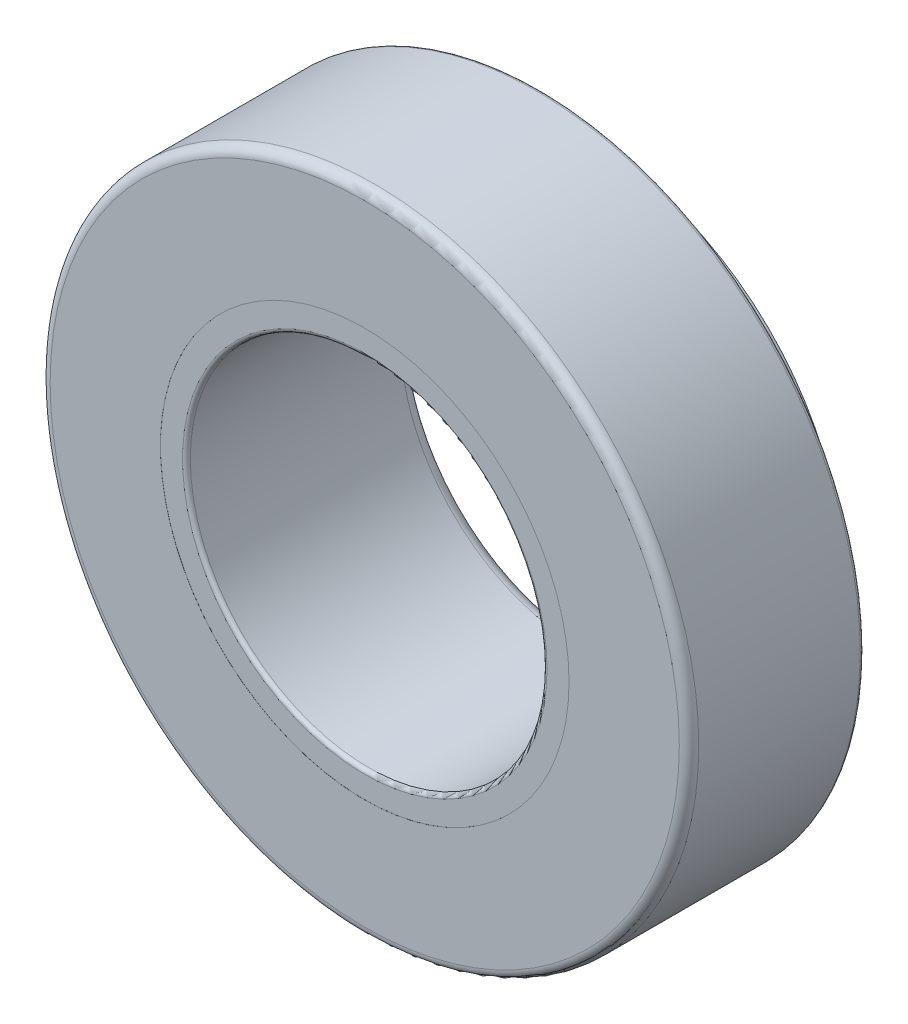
ISO-10303-21;
HEADER;
FILE_DESCRIPTION(('STEP AP214'),'2;1');
FILE_NAME('part.step','',(''),(''),'','','');
FILE_SCHEMA(('AUTOMOTIVE_DESIGN { 1 0 10303 214 1 1 1 1 }'));
ENDSEC;
DATA;
#1=APPLICATION_CONTEXT('core data for automotive mechanical design processes');
#2=APPLICATION_PROTOCOL_DEFINITION('international standard','automotive_design',2000,#1);
#3=PRODUCT_CONTEXT('',#1,'mechanical');
#4=PRODUCT('Part','Part','',(#3));
#5=PRODUCT_RELATED_PRODUCT_CATEGORY('part','',(#4));
#6=PRODUCT_DEFINITION_FORMATION('','',#4);
#7=PRODUCT_DEFINITION_CONTEXT('part definition',#1,'design');
#8=PRODUCT_DEFINITION('design','',#6,#7);
#9=PRODUCT_DEFINITION_SHAPE('','',#8);
#10=(LENGTH_UNIT() NAMED_UNIT(*) SI_UNIT(.MILLI.,.METRE.));
#11=(NAMED_UNIT(*) PLANE_ANGLE_UNIT() SI_UNIT($,.RADIAN.));
#12=(NAMED_UNIT(*) SI_UNIT($,.STERADIAN.) SOLID_ANGLE_UNIT());
#13=UNCERTAINTY_MEASURE_WITH_UNIT(LENGTH_MEASURE(1.E-05),#10,'distance_accuracy_value','');
#14=(GEOMETRIC_REPRESENTATION_CONTEXT(3) GLOBAL_UNCERTAINTY_ASSIGNED_CONTEXT((#13)) GLOBAL_UNIT_ASSIGNED_CONTEXT((#10,
#11,#12)) REPRESENTATION_CONTEXT('',''));
#15=CARTESIAN_POINT('',(0.,0.,0.));
#16=DIRECTION('',(0.,0.,1.));
#17=DIRECTION('',(1.,0.,0.));
#18=AXIS2_PLACEMENT_3D('',#15,#16,#17);
#19=CARTESIAN_POINT('',(0.,0.,59.9913216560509));
#20=DIRECTION('',(0.,0.,1.));
#21=DIRECTION('',(1.,0.,0.));
#22=AXIS2_PLACEMENT_3D('',#19,#20,#21);
#23=CYLINDRICAL_SURFACE('',#22,38.8);
#24=CARTESIAN_POINT('',(0.,0.,-31.));
#25=DIRECTION('',(0.,0.,1.));
#26=DIRECTION('',(1.,0.,0.));
#27=AXIS2_PLACEMENT_3D('',#24,#25,#26);
#28=CIRCLE('',#27,38.8);
#29=CARTESIAN_POINT('',(38.8,0.,-31.));
#30=VERTEX_POINT('',#29);
#31=EDGE_CURVE('E10',#30,#30,#28,.T.);
#32=ORIENTED_EDGE('',*,*,#31,.F.);
#33=EDGE_LOOP('',(#32));
#34=FACE_BOUND('',#33,.T.);
#35=CARTESIAN_POINT('',(0.,0.,-35.));
#36=DIRECTION('',(0.,0.,1.));
#37=DIRECTION('',(1.,0.,0.));
#38=AXIS2_PLACEMENT_3D('',#35,#36,#37);
#39=CIRCLE('',#38,38.8);
#40=CARTESIAN_POINT('',(38.8,0.,-35.));
#41=VERTEX_POINT('',#40);
#42=EDGE_CURVE('E76',#41,#41,#39,.T.);
#43=ORIENTED_EDGE('',*,*,#42,.T.);
#44=EDGE_LOOP('',(#43));
#45=FACE_BOUND('',#44,.T.);
#46=ADVANCED_FACE('F30',(#34,#45),#23,.T.);
#47=CARTESIAN_POINT('',(0.,38.8,-31.));
#48=DIRECTION('',(0.,0.,1.));
#49=DIRECTION('',(1.,0.,0.));
#50=AXIS2_PLACEMENT_3D('',#47,#48,#49);
#51=PLANE('',#50);
#52=CARTESIAN_POINT('',(0.,0.,-31.));
#53=DIRECTION('',(0.,0.,1.));
#54=DIRECTION('',(1.,0.,0.));
#55=AXIS2_PLACEMENT_3D('',#52,#53,#54);
#56=CIRCLE('',#55,42.5);
#57=CARTESIAN_POINT('',(42.5,0.,-31.));
#58=VERTEX_POINT('',#57);
#59=EDGE_CURVE('E36',#58,#58,#56,.T.);
#60=ORIENTED_EDGE('',*,*,#59,.F.);
#61=EDGE_LOOP('',(#60));
#62=FACE_BOUND('',#61,.T.);
#63=ORIENTED_EDGE('',*,*,#31,.T.);
#64=EDGE_LOOP('',(#63));
#65=FACE_BOUND('',#64,.T.);
#66=ADVANCED_FACE('F193',(#62,#65),#51,.F.);
#67=CARTESIAN_POINT('',(0.,0.,-31.));
#68=DIRECTION('',(0.,0.,-1.));
#69=DIRECTION('',(-1.,0.,0.));
#70=AXIS2_PLACEMENT_3D('',#67,#68,#69);
#71=CONICAL_SURFACE('',#70,42.5,0.191184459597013);
#72=CARTESIAN_POINT('',(0.,0.,-27.));
#73=DIRECTION('',(0.,0.,1.));
#74=DIRECTION('',(1.,0.,0.));
#75=AXIS2_PLACEMENT_3D('',#72,#73,#74);
#76=CIRCLE('',#75,41.7258064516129);
#77=CARTESIAN_POINT('',(41.7258064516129,0.,-27.));
#78=VERTEX_POINT('',#77);
#79=EDGE_CURVE('E40',#78,#78,#76,.T.);
#80=ORIENTED_EDGE('',*,*,#79,.F.);
#81=EDGE_LOOP('',(#80));
#82=FACE_BOUND('',#81,.T.);
#83=ORIENTED_EDGE('',*,*,#59,.T.);
#84=EDGE_LOOP('',(#83));
#85=FACE_BOUND('',#84,.T.);
#86=ADVANCED_FACE('F190',(#82,#85),#71,.T.);
#87=CARTESIAN_POINT('',(0.,41.7258064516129,-27.));
#88=DIRECTION('',(0.,0.,1.));
#89=DIRECTION('',(1.,0.,0.));
#90=AXIS2_PLACEMENT_3D('',#87,#88,#89);
#91=PLANE('',#90);
#92=CARTESIAN_POINT('',(0.,0.,-27.));
#93=DIRECTION('',(0.,0.,1.));
#94=DIRECTION('',(1.,0.,0.));
#95=AXIS2_PLACEMENT_3D('',#92,#93,#94);
#96=CIRCLE('',#95,49.4);
#97=CARTESIAN_POINT('',(49.4,0.,-27.));
#98=VERTEX_POINT('',#97);
#99=EDGE_CURVE('E44',#98,#98,#96,.T.);
#100=ORIENTED_EDGE('',*,*,#99,.F.);
#101=EDGE_LOOP('',(#100));
#102=FACE_BOUND('',#101,.T.);
#103=ORIENTED_EDGE('',*,*,#79,.T.);
#104=EDGE_LOOP('',(#103));
#105=FACE_BOUND('',#104,.T.);
#106=ADVANCED_FACE('F186',(#102,#105),#91,.F.);
#107=CARTESIAN_POINT('',(0.,0.,-26.4));
#108=DIRECTION('',(0.,0.,1.));
#109=DIRECTION('',(1.,0.,0.));
#110=AXIS2_PLACEMENT_3D('',#107,#108,#109);
#111=TOROIDAL_SURFACE('',#110,49.4,0.600000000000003);
#112=CARTESIAN_POINT('',(0.,0.,-26.4));
#113=DIRECTION('',(0.,0.,1.));
#114=DIRECTION('',(1.,0.,0.));
#115=AXIS2_PLACEMENT_3D('',#112,#113,#114);
#116=CIRCLE('',#115,50.);
#117=CARTESIAN_POINT('',(50.,0.,-26.4));
#118=VERTEX_POINT('',#117);
#119=EDGE_CURVE('E49',#118,#118,#116,.T.);
#120=ORIENTED_EDGE('',*,*,#119,.F.);
#121=EDGE_LOOP('',(#120));
#122=FACE_BOUND('',#121,.T.);
#123=ORIENTED_EDGE('',*,*,#99,.T.);
#124=EDGE_LOOP('',(#123));
#125=FACE_BOUND('',#124,.T.);
#126=ADVANCED_FACE('F182',(#122,#125),#111,.T.);
#127=CARTESIAN_POINT('',(0.,0.,59.9913216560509));
#128=DIRECTION('',(0.,0.,1.));
#129=DIRECTION('',(1.,0.,0.));
#130=AXIS2_PLACEMENT_3D('',#127,#128,#129);
#131=CYLINDRICAL_SURFACE('',#130,50.);
#132=ORIENTED_EDGE('',*,*,#119,.T.);
#133=EDGE_LOOP('',(#132));
#134=FACE_BOUND('',#133,.T.);
#135=CARTESIAN_POINT('',(0.,0.,-1.5));
#136=DIRECTION('',(0.,0.,1.));
#137=DIRECTION('',(1.,0.,0.));
#138=AXIS2_PLACEMENT_3D('',#135,#136,#137);
#139=CIRCLE('',#138,50.);
#140=CARTESIAN_POINT('',(50.,0.,-1.5));
#141=VERTEX_POINT('',#140);
#142=EDGE_CURVE('E52',#141,#141,#139,.T.);
#143=ORIENTED_EDGE('',*,*,#142,.F.);
#144=EDGE_LOOP('',(#143));
#145=FACE_BOUND('',#144,.T.);
#146=ADVANCED_FACE('F178',(#134,#145),#131,.T.);
#147=CARTESIAN_POINT('',(0.,0.,-1.5));
#148=DIRECTION('',(0.,0.,1.));
#149=DIRECTION('',(1.,0.,0.));
#150=AXIS2_PLACEMENT_3D('',#147,#148,#149);
#151=TOROIDAL_SURFACE('',#150,48.5,1.5);
#152=CARTESIAN_POINT('',(0.,0.,0.));
#153=DIRECTION('',(0.,0.,1.));
#154=DIRECTION('',(1.,0.,0.));
#155=AXIS2_PLACEMENT_3D('',#152,#153,#154);
#156=CIRCLE('',#155,48.5);
#157=CARTESIAN_POINT('',(48.5,0.,0.));
#158=VERTEX_POINT('',#157);
#159=EDGE_CURVE('E55',#158,#158,#156,.T.);
#160=ORIENTED_EDGE('',*,*,#159,.F.);
#161=EDGE_LOOP('',(#160));
#162=FACE_BOUND('',#161,.T.);
#163=ORIENTED_EDGE('',*,*,#142,.T.);
#164=EDGE_LOOP('',(#163));
#165=FACE_BOUND('',#164,.T.);
#166=ADVANCED_FACE('F174',(#162,#165),#151,.T.);
#167=CARTESIAN_POINT('',(0.,31.5,0.));
#168=DIRECTION('',(0.,0.,1.));
#169=DIRECTION('',(1.,0.,0.));
#170=AXIS2_PLACEMENT_3D('',#167,#168,#169);
#171=PLANE('',#170);
#172=ORIENTED_EDGE('',*,*,#159,.T.);
#173=EDGE_LOOP('',(#172));
#174=FACE_BOUND('',#173,.T.);
#175=CARTESIAN_POINT('',(0.,0.,0.));
#176=DIRECTION('',(0.,0.,1.));
#177=DIRECTION('',(1.,0.,0.));
#178=AXIS2_PLACEMENT_3D('',#175,#176,#177);
#179=CIRCLE('',#178,31.5);
#180=CARTESIAN_POINT('',(31.5,0.,0.));
#181=VERTEX_POINT('',#180);
#182=EDGE_CURVE('E58',#181,#181,#179,.T.);
#183=ORIENTED_EDGE('',*,*,#182,.F.);
#184=EDGE_LOOP('',(#183));
#185=FACE_BOUND('',#184,.T.);
#186=ADVANCED_FACE('F170',(#174,#185),#171,.T.);
#187=CARTESIAN_POINT('',(0.,0.,59.9913216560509));
#188=DIRECTION('',(0.,0.,1.));
#189=DIRECTION('',(1.,0.,0.));
#190=AXIS2_PLACEMENT_3D('',#187,#188,#189);
#191=CYLINDRICAL_SURFACE('',#190,31.5);
#192=ORIENTED_EDGE('',*,*,#182,.T.);
#193=EDGE_LOOP('',(#192));
#194=FACE_BOUND('',#193,.T.);
#195=CARTESIAN_POINT('',(0.,0.,-0.0100000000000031));
#196=DIRECTION('',(0.,0.,1.));
#197=DIRECTION('',(1.,0.,0.));
#198=AXIS2_PLACEMENT_3D('',#195,#196,#197);
#199=CIRCLE('',#198,31.5);
#200=CARTESIAN_POINT('',(31.5,0.,-0.0100000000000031));
#201=VERTEX_POINT('',#200);
#202=EDGE_CURVE('E61',#201,#201,#199,.T.);
#203=ORIENTED_EDGE('',*,*,#202,.F.);
#204=EDGE_LOOP('',(#203));
#205=FACE_BOUND('',#204,.T.);
#206=ADVANCED_FACE('F166',(#194,#205),#191,.F.);
#207=CARTESIAN_POINT('',(0.,28.1,-0.0100000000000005));
#208=DIRECTION('',(0.,0.,1.));
#209=DIRECTION('',(1.,0.,0.));
#210=AXIS2_PLACEMENT_3D('',#207,#208,#209);
#211=PLANE('',#210);
#212=ORIENTED_EDGE('',*,*,#202,.T.);
#213=EDGE_LOOP('',(#212));
#214=FACE_BOUND('',#213,.T.);
#215=CARTESIAN_POINT('',(0.,0.,-0.00999999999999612));
#216=DIRECTION('',(0.,0.,1.));
#217=DIRECTION('',(1.,0.,0.));
#218=AXIS2_PLACEMENT_3D('',#215,#216,#217);
#219=CIRCLE('',#218,28.1);
#220=CARTESIAN_POINT('',(28.1,0.,-0.00999999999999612));
#221=VERTEX_POINT('',#220);
#222=EDGE_CURVE('E64',#221,#221,#219,.T.);
#223=ORIENTED_EDGE('',*,*,#222,.F.);
#224=EDGE_LOOP('',(#223));
#225=FACE_BOUND('',#224,.T.);
#226=ADVANCED_FACE('F162',(#214,#225),#211,.T.);
#227=CARTESIAN_POINT('',(0.,0.,-0.609999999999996));
#228=DIRECTION('',(0.,0.,1.));
#229=DIRECTION('',(1.,0.,0.));
#230=AXIS2_PLACEMENT_3D('',#227,#228,#229);
#231=TOROIDAL_SURFACE('',#230,28.1,0.599999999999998);
#232=CARTESIAN_POINT('',(0.,0.,-0.609999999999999));
#233=DIRECTION('',(0.,0.,1.));
#234=DIRECTION('',(1.,0.,0.));
#235=AXIS2_PLACEMENT_3D('',#232,#233,#234);
#236=CIRCLE('',#235,27.5);
#237=CARTESIAN_POINT('',(27.5,0.,-0.609999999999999));
#238=VERTEX_POINT('',#237);
#239=EDGE_CURVE('E67',#238,#238,#236,.T.);
#240=ORIENTED_EDGE('',*,*,#239,.F.);
#241=EDGE_LOOP('',(#240));
#242=FACE_BOUND('',#241,.T.);
#243=ORIENTED_EDGE('',*,*,#222,.T.);
#244=EDGE_LOOP('',(#243));
#245=FACE_BOUND('',#244,.T.);
#246=ADVANCED_FACE('F158',(#242,#245),#231,.T.);
#247=CARTESIAN_POINT('',(0.,0.,59.9913216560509));
#248=DIRECTION('',(0.,0.,1.));
#249=DIRECTION('',(1.,0.,0.));
#250=AXIS2_PLACEMENT_3D('',#247,#248,#249);
#251=CYLINDRICAL_SURFACE('',#250,27.5);
#252=CARTESIAN_POINT('',(0.,0.,-33.));
#253=DIRECTION('',(0.,0.,1.));
#254=DIRECTION('',(1.,0.,0.));
#255=AXIS2_PLACEMENT_3D('',#252,#253,#254);
#256=CIRCLE('',#255,27.5);
#257=CARTESIAN_POINT('',(27.5,0.,-33.));
#258=VERTEX_POINT('',#257);
#259=EDGE_CURVE('E70',#258,#258,#256,.T.);
#260=ORIENTED_EDGE('',*,*,#259,.F.);
#261=EDGE_LOOP('',(#260));
#262=FACE_BOUND('',#261,.T.);
#263=ORIENTED_EDGE('',*,*,#239,.T.);
#264=EDGE_LOOP('',(#263));
#265=FACE_BOUND('',#264,.T.);
#266=ADVANCED_FACE('F154',(#262,#265),#251,.F.);
#267=CARTESIAN_POINT('',(0.,0.,-33.));
#268=DIRECTION('',(0.,0.,1.));
#269=DIRECTION('',(1.,0.,0.));
#270=AXIS2_PLACEMENT_3D('',#267,#268,#269);
#271=TOROIDAL_SURFACE('',#270,29.5,2.);
#272=ORIENTED_EDGE('',*,*,#259,.T.);
#273=EDGE_LOOP('',(#272));
#274=FACE_BOUND('',#273,.T.);
#275=CARTESIAN_POINT('',(0.,0.,-35.));
#276=DIRECTION('',(0.,0.,1.));
#277=DIRECTION('',(1.,0.,0.));
#278=AXIS2_PLACEMENT_3D('',#275,#276,#277);
#279=CIRCLE('',#278,29.5);
#280=CARTESIAN_POINT('',(29.5,0.,-35.));
#281=VERTEX_POINT('',#280);
#282=EDGE_CURVE('E73',#281,#281,#279,.T.);
#283=ORIENTED_EDGE('',*,*,#282,.F.);
#284=EDGE_LOOP('',(#283));
#285=FACE_BOUND('',#284,.T.);
#286=ADVANCED_FACE('F150',(#274,#285),#271,.T.);
#287=CARTESIAN_POINT('',(0.,29.5,-35.));
#288=DIRECTION('',(0.,0.,1.));
#289=DIRECTION('',(1.,0.,0.));
#290=AXIS2_PLACEMENT_3D('',#287,#288,#289);
#291=PLANE('',#290);
#292=ORIENTED_EDGE('',*,*,#42,.F.);
#293=EDGE_LOOP('',(#292));
#294=FACE_BOUND('',#293,.T.);
#295=ORIENTED_EDGE('',*,*,#282,.T.);
#296=EDGE_LOOP('',(#295));
#297=FACE_BOUND('',#296,.T.);
#298=ADVANCED_FACE('F148',(#294,#297),#291,.F.);
#299=CLOSED_SHELL('',(#46,#66,#86,#106,#126,#146,#166,#186,#206,#226,#246,#266,#286,#298));
#300=CARTESIAN_POINT('',(0.,0.,-26.9710997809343));
#301=DIRECTION('',(0.,0.,1.));
#302=DIRECTION('',(1.,0.,0.));
#303=AXIS2_PLACEMENT_3D('',#300,#301,#302);
#304=CONICAL_SURFACE('',#303,41.7253056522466,1.3796118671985);
#305=CARTESIAN_POINT('',(0.,0.,-26.973));
#306=DIRECTION('',(0.,0.,1.));
#307=DIRECTION('',(1.,0.,0.));
#308=AXIS2_PLACEMENT_3D('',#305,#306,#307);
#309=CIRCLE('',#308,41.7154878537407);
#310=CARTESIAN_POINT('',(41.7154878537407,0.,-26.973));
#311=VERTEX_POINT('',#310);
#312=EDGE_CURVE('E88',#311,#311,#309,.T.);
#313=ORIENTED_EDGE('',*,*,#312,.F.);
#314=EDGE_LOOP('',(#313));
#315=FACE_BOUND('',#314,.T.);
#316=CARTESIAN_POINT('',(0.,0.,-26.9710997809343));
#317=DIRECTION('',(0.,0.,1.));
#318=DIRECTION('',(1.,0.,0.));
#319=AXIS2_PLACEMENT_3D('',#316,#317,#318);
#320=CIRCLE('',#319,41.7253056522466);
#321=CARTESIAN_POINT('',(41.7253056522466,0.,-26.9710997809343));
#322=VERTEX_POINT('',#321);
#323=EDGE_CURVE('E79',#322,#322,#320,.T.);
#324=ORIENTED_EDGE('',*,*,#323,.T.);
#325=EDGE_LOOP('',(#324));
#326=FACE_BOUND('',#325,.T.);
#327=ADVANCED_FACE('F132',(#315,#326),#304,.F.);
#328=CARTESIAN_POINT('',(0.,0.,-0.0269999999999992));
#329=DIRECTION('',(0.,0.,-1.));
#330=DIRECTION('',(-1.,0.,0.));
#331=AXIS2_PLACEMENT_3D('',#328,#329,#330);
#332=CONICAL_SURFACE('',#331,36.5103185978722,0.191184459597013);
#333=ORIENTED_EDGE('',*,*,#323,.F.);
#334=EDGE_LOOP('',(#333));
#335=FACE_BOUND('',#334,.T.);
#336=CARTESIAN_POINT('',(0.,0.,-0.0269999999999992));
#337=DIRECTION('',(0.,0.,1.));
#338=DIRECTION('',(1.,0.,0.));
#339=AXIS2_PLACEMENT_3D('',#336,#337,#338);
#340=CIRCLE('',#339,36.5103185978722);
#341=CARTESIAN_POINT('',(36.5103185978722,0.,-0.0269999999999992));
#342=VERTEX_POINT('',#341);
#343=EDGE_CURVE('E82',#342,#342,#340,.T.);
#344=ORIENTED_EDGE('',*,*,#343,.T.);
#345=EDGE_LOOP('',(#344));
#346=FACE_BOUND('',#345,.T.);
#347=ADVANCED_FACE('F134',(#335,#346),#332,.F.);
#348=CARTESIAN_POINT('',(0.,0.,-0.0289002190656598));
#349=DIRECTION('',(0.,0.,1.));
#350=DIRECTION('',(1.,0.,0.));
#351=AXIS2_PLACEMENT_3D('',#348,#349,#350);
#352=CONICAL_SURFACE('',#351,36.5005007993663,1.37961186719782);
#353=ORIENTED_EDGE('',*,*,#343,.F.);
#354=EDGE_LOOP('',(#353));
#355=FACE_BOUND('',#354,.T.);
#356=CARTESIAN_POINT('',(0.,0.,-0.0289002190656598));
#357=DIRECTION('',(0.,0.,1.));
#358=DIRECTION('',(1.,0.,0.));
#359=AXIS2_PLACEMENT_3D('',#356,#357,#358);
#360=CIRCLE('',#359,36.5005007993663);
#361=CARTESIAN_POINT('',(36.5005007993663,0.,-0.0289002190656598));
#362=VERTEX_POINT('',#361);
#363=EDGE_CURVE('E85',#362,#362,#360,.T.);
#364=ORIENTED_EDGE('',*,*,#363,.T.);
#365=EDGE_LOOP('',(#364));
#366=FACE_BOUND('',#365,.T.);
#367=ADVANCED_FACE('F141',(#355,#366),#352,.T.);
#368=CARTESIAN_POINT('',(0.,0.,-0.0289002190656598));
#369=DIRECTION('',(0.,0.,-1.));
#370=DIRECTION('',(-1.,0.,0.));
#371=AXIS2_PLACEMENT_3D('',#368,#369,#370);
#372=CONICAL_SURFACE('',#371,36.5005007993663,0.191184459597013);
#373=ORIENTED_EDGE('',*,*,#312,.T.);
#374=EDGE_LOOP('',(#373));
#375=FACE_BOUND('',#374,.T.);
#376=ORIENTED_EDGE('',*,*,#363,.F.);
#377=EDGE_LOOP('',(#376));
#378=FACE_BOUND('',#377,.T.);
#379=ADVANCED_FACE('F303',(#375,#378),#372,.T.);
#380=CLOSED_SHELL('',(#327,#347,#367,#379));
#381=CARTESIAN_POINT('',(0.,0.,-10.8720358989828));
#382=DIRECTION('',(0.,0.,1.));
#383=DIRECTION('',(1.,0.,0.));
#384=AXIS2_PLACEMENT_3D('',#381,#382,#383);
#385=CONICAL_SURFACE('',#384,32.8850602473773,1.37961186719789);
#386=CARTESIAN_POINT('',(0.,0.,-10.8739361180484));
#387=DIRECTION('',(0.,0.,1.));
#388=DIRECTION('',(1.,0.,0.));
#389=AXIS2_PLACEMENT_3D('',#386,#387,#388);
#390=CIRCLE('',#389,32.8752424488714);
#391=CARTESIAN_POINT('',(32.8752424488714,0.,-10.8739361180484));
#392=VERTEX_POINT('',#391);
#393=EDGE_CURVE('E100',#392,#392,#390,.T.);
#394=ORIENTED_EDGE('',*,*,#393,.T.);
#395=EDGE_LOOP('',(#394));
#396=FACE_BOUND('',#395,.T.);
#397=CARTESIAN_POINT('',(0.,0.,-10.8720358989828));
#398=DIRECTION('',(0.,0.,1.));
#399=DIRECTION('',(1.,0.,0.));
#400=AXIS2_PLACEMENT_3D('',#397,#398,#399);
#401=CIRCLE('',#400,32.8850602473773);
#402=CARTESIAN_POINT('',(32.8850602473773,0.,-10.8720358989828));
#403=VERTEX_POINT('',#402);
#404=EDGE_CURVE('E91',#403,#403,#401,.T.);
#405=ORIENTED_EDGE('',*,*,#404,.F.);
#406=EDGE_LOOP('',(#405));
#407=FACE_BOUND('',#406,.T.);
#408=ADVANCED_FACE('F104',(#396,#407),#385,.T.);
#409=CARTESIAN_POINT('',(0.,0.,-24.1260638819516));
#410=DIRECTION('',(0.,0.,-1.));
#411=DIRECTION('',(-1.,0.,0.));
#412=AXIS2_PLACEMENT_3D('',#409,#410,#411);
#413=CONICAL_SURFACE('',#412,35.4503559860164,0.191184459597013);
#414=ORIENTED_EDGE('',*,*,#404,.T.);
#415=EDGE_LOOP('',(#414));
#416=FACE_BOUND('',#415,.T.);
#417=CARTESIAN_POINT('',(0.,0.,-24.1260638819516));
#418=DIRECTION('',(0.,0.,1.));
#419=DIRECTION('',(1.,0.,0.));
#420=AXIS2_PLACEMENT_3D('',#417,#418,#419);
#421=CIRCLE('',#420,35.4503559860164);
#422=CARTESIAN_POINT('',(35.4503559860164,0.,-24.1260638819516));
#423=VERTEX_POINT('',#422);
#424=EDGE_CURVE('E94',#423,#423,#421,.T.);
#425=ORIENTED_EDGE('',*,*,#424,.F.);
#426=EDGE_LOOP('',(#425));
#427=FACE_BOUND('',#426,.T.);
#428=ADVANCED_FACE('F118',(#416,#427),#413,.F.);
#429=CARTESIAN_POINT('',(0.,0.,-24.1260638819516));
#430=DIRECTION('',(0.,0.,1.));
#431=DIRECTION('',(1.,0.,0.));
#432=AXIS2_PLACEMENT_3D('',#429,#430,#431);
#433=CONICAL_SURFACE('',#432,35.4503559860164,1.37961186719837);
#434=CARTESIAN_POINT('',(0.,0.,-24.1279641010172));
#435=DIRECTION('',(0.,0.,1.));
#436=DIRECTION('',(1.,0.,0.));
#437=AXIS2_PLACEMENT_3D('',#434,#435,#436);
#438=CIRCLE('',#437,35.4405381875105);
#439=CARTESIAN_POINT('',(35.4405381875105,0.,-24.1279641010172));
#440=VERTEX_POINT('',#439);
#441=EDGE_CURVE('E97',#440,#440,#438,.T.);
#442=ORIENTED_EDGE('',*,*,#441,.F.);
#443=EDGE_LOOP('',(#442));
#444=FACE_BOUND('',#443,.T.);
#445=ORIENTED_EDGE('',*,*,#424,.T.);
#446=EDGE_LOOP('',(#445));
#447=FACE_BOUND('',#446,.T.);
#448=ADVANCED_FACE('F110',(#444,#447),#433,.F.);
#449=CARTESIAN_POINT('',(0.,0.,-24.1279641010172));
#450=DIRECTION('',(0.,0.,-1.));
#451=DIRECTION('',(-1.,0.,0.));
#452=AXIS2_PLACEMENT_3D('',#449,#450,#451);
#453=CONICAL_SURFACE('',#452,35.4405381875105,0.191184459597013);
#454=ORIENTED_EDGE('',*,*,#393,.F.);
#455=EDGE_LOOP('',(#454));
#456=FACE_BOUND('',#455,.T.);
#457=ORIENTED_EDGE('',*,*,#441,.T.);
#458=EDGE_LOOP('',(#457));
#459=FACE_BOUND('',#458,.T.);
#460=ADVANCED_FACE('F107',(#456,#459),#453,.T.);
#461=CLOSED_SHELL('',(#408,#428,#448,#460));
#462=ORIENTED_CLOSED_SHELL('',*,#380,.T.);
#463=ORIENTED_CLOSED_SHELL('',*,#461,.T.);
#464=BREP_WITH_VOIDS('B2',#299,(#462,#463));
#465=ADVANCED_BREP_SHAPE_REPRESENTATION('',(#18,#464),#14);
#466=SHAPE_DEFINITION_REPRESENTATION(#9,#465);
ENDSEC;
END-ISO-10303-21;
